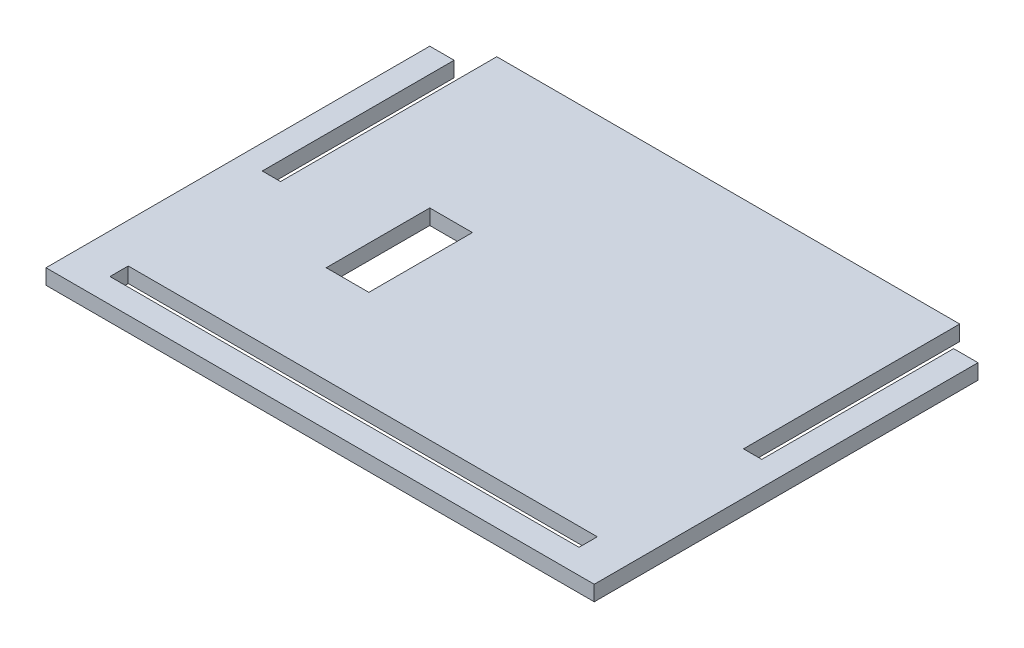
from build123d import *

# Parameters (mm, degrees)
SKETCH1_W           = 77
SKETCH1_H           = 3
SKETCH1_W_2         = 7
SKETCH1_H_2         = 15
BOSS_EXTRUDE1_DEPTH = 2.5
SKETCH2_W           = 76
SKETCH2_H           = 4
BOSS_EXTRUDE2_DEPTH = 2.5
SKETCH3_W           = 7
SKETCH3_H           = 17
CUT_EXTRUDE1_DEPTH  = 58.37159576


with BuildPart() as part:
    # Sketch1 → Boss-Extrude1 (new body)
    with BuildSketch(Plane(origin=(0, 0, 0), x_dir=(1, 0, 0), z_dir=(0, 1, 0))):
        Polygon((-41, 31.5), (-41, 0), (-38, 0), (-38, 31.5), (38, 31.5), (38, 0), (41, 0), (41, 31.5), (45, 31.5), (45, -31.5), (-45, -31.5), (-45, 31.5), align=None)
        with Locations((0, -26)):
            Rectangle(SKETCH1_W, SKETCH1_H, mode=Mode.SUBTRACT)
        with Locations((-18.5, 0)):
            Rectangle(SKETCH1_W_2, SKETCH1_H_2, mode=Mode.SUBTRACT)
    extrude(amount=BOSS_EXTRUDE1_DEPTH)

    # Sketch2 → Boss-Extrude2 (add)
    with BuildSketch(Plane(origin=(0, 2.5, 0), x_dir=(1, 0, 0), z_dir=(0, 1, 0))):
        with Locations((0, 33.5)):
            Rectangle(SKETCH2_W, SKETCH2_H)
    extrude(amount=-BOSS_EXTRUDE2_DEPTH)

    # Sketch3 → Cut-Extrude1 (cut, through all)
    with BuildSketch(Plane(origin=(0, 2.5, 0), x_dir=(1, 0, 0), z_dir=(0, 1, 0))):
        with Locations((-18.5, 0)):
            Rectangle(SKETCH3_W, SKETCH3_H)
    extrude(amount=-CUT_EXTRUDE1_DEPTH, mode=Mode.SUBTRACT)


solid = part.part
